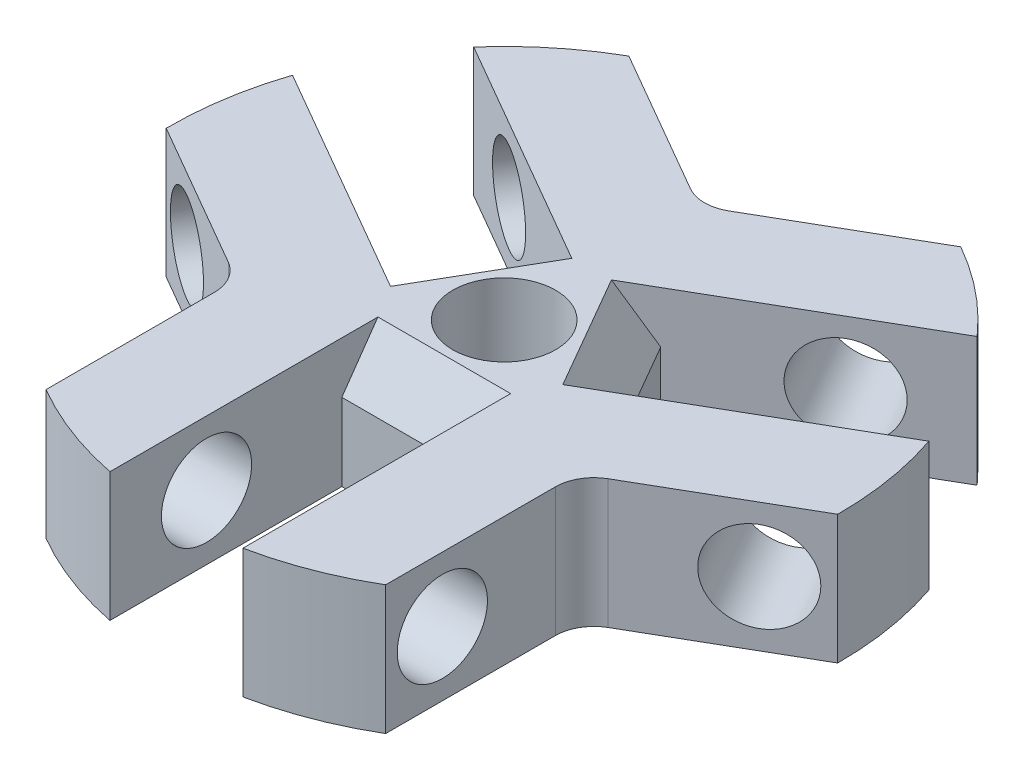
ISO-10303-21;
HEADER;
FILE_DESCRIPTION(('STEP AP214'),'2;1');
FILE_NAME('part.step','',(''),(''),'','','');
FILE_SCHEMA(('AUTOMOTIVE_DESIGN { 1 0 10303 214 1 1 1 1 }'));
ENDSEC;
DATA;
#1=APPLICATION_CONTEXT('core data for automotive mechanical design processes');
#2=APPLICATION_PROTOCOL_DEFINITION('international standard','automotive_design',2000,#1);
#3=PRODUCT_CONTEXT('',#1,'mechanical');
#4=PRODUCT('Part','Part','',(#3));
#5=PRODUCT_RELATED_PRODUCT_CATEGORY('part','',(#4));
#6=PRODUCT_DEFINITION_FORMATION('','',#4);
#7=PRODUCT_DEFINITION_CONTEXT('part definition',#1,'design');
#8=PRODUCT_DEFINITION('design','',#6,#7);
#9=PRODUCT_DEFINITION_SHAPE('','',#8);
#10=(LENGTH_UNIT() NAMED_UNIT(*) SI_UNIT(.MILLI.,.METRE.));
#11=(NAMED_UNIT(*) PLANE_ANGLE_UNIT() SI_UNIT($,.RADIAN.));
#12=(NAMED_UNIT(*) SI_UNIT($,.STERADIAN.) SOLID_ANGLE_UNIT());
#13=UNCERTAINTY_MEASURE_WITH_UNIT(LENGTH_MEASURE(1.E-05),#10,'distance_accuracy_value','');
#14=(GEOMETRIC_REPRESENTATION_CONTEXT(3) GLOBAL_UNCERTAINTY_ASSIGNED_CONTEXT((#13)) GLOBAL_UNIT_ASSIGNED_CONTEXT((#10,
#11,#12)) REPRESENTATION_CONTEXT('',''));
#15=CARTESIAN_POINT('',(0.,0.,0.));
#16=DIRECTION('',(0.,0.,1.));
#17=DIRECTION('',(1.,0.,0.));
#18=AXIS2_PLACEMENT_3D('',#15,#16,#17);
#19=CARTESIAN_POINT('',(0.,0.,0.));
#20=DIRECTION('',(0.,-1.,0.));
#21=DIRECTION('',(0.,0.,-1.));
#22=AXIS2_PLACEMENT_3D('',#19,#20,#21);
#23=CYLINDRICAL_SURFACE('',#22,13.);
#24=CARTESIAN_POINT('',(0.,0.,0.));
#25=DIRECTION('',(0.,-1.,0.));
#26=DIRECTION('',(0.,0.,-1.));
#27=AXIS2_PLACEMENT_3D('',#24,#25,#26);
#28=CIRCLE('',#27,13.);
#29=CARTESIAN_POINT('',(-12.9994845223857,0.,0.115767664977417));
#30=VERTEX_POINT('',#29);
#31=CARTESIAN_POINT('',(-12.3308657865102,-1.11022302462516E-13,-4.11700728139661));
#32=VERTEX_POINT('',#31);
#33=EDGE_CURVE('E235',#30,#32,#28,.T.);
#34=ORIENTED_EDGE('',*,*,#33,.F.);
#35=DIRECTION('',(0.,1.,0.));
#36=VECTOR('',#35,1.);
#37=CARTESIAN_POINT('',(-12.9994845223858,-5.00000000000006,0.115767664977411));
#38=LINE('',#37,#36);
#39=CARTESIAN_POINT('',(-12.9994845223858,4.99999999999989,0.11576766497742));
#40=VERTEX_POINT('',#39);
#41=EDGE_CURVE('E222',#30,#40,#38,.T.);
#42=ORIENTED_EDGE('',*,*,#41,.T.);
#43=CARTESIAN_POINT('',(0.,5.,0.));
#44=DIRECTION('',(0.,-1.,0.));
#45=DIRECTION('',(0.,0.,-1.));
#46=AXIS2_PLACEMENT_3D('',#43,#44,#45);
#47=CIRCLE('',#46,13.);
#48=CARTESIAN_POINT('',(-12.3308657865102,4.99999999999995,-4.11700728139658));
#49=VERTEX_POINT('',#48);
#50=EDGE_CURVE('E233',#40,#49,#47,.T.);
#51=ORIENTED_EDGE('',*,*,#50,.T.);
#52=DIRECTION('',(0.,-1.,0.));
#53=VECTOR('',#52,1.);
#54=CARTESIAN_POINT('',(-12.3308657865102,-1.11022302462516E-13,-4.11700728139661));
#55=LINE('',#54,#53);
#56=EDGE_CURVE('E333',#49,#32,#55,.T.);
#57=ORIENTED_EDGE('',*,*,#56,.T.);
#58=EDGE_LOOP('',(#34,#42,#51,#57));
#59=FACE_BOUND('',#58,.T.);
#60=ADVANCED_FACE('F38',(#59),#23,.T.);
#61=CARTESIAN_POINT('',(6.39948452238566,0.,-11.3157676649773));
#62=VERTEX_POINT('',#61);
#63=CARTESIAN_POINT('',(9.7308657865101,0.,-8.6203393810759));
#64=VERTEX_POINT('',#63);
#65=EDGE_CURVE('E272',#62,#64,#28,.T.);
#66=ORIENTED_EDGE('',*,*,#65,.F.);
#67=DIRECTION('',(0.,1.,0.));
#68=VECTOR('',#67,1.);
#69=CARTESIAN_POINT('',(6.39948452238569,-5.00000000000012,-11.3157676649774));
#70=LINE('',#69,#68);
#71=CARTESIAN_POINT('',(6.39948452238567,4.99999999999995,-11.3157676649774));
#72=VERTEX_POINT('',#71);
#73=EDGE_CURVE('E299',#62,#72,#70,.T.);
#74=ORIENTED_EDGE('',*,*,#73,.T.);
#75=CARTESIAN_POINT('',(9.73086578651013,5.,-8.6203393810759));
#76=VERTEX_POINT('',#75);
#77=EDGE_CURVE('E245',#72,#76,#47,.T.);
#78=ORIENTED_EDGE('',*,*,#77,.T.);
#79=DIRECTION('',(0.,-1.,0.));
#80=VECTOR('',#79,1.);
#81=CARTESIAN_POINT('',(9.7308657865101,0.,-8.6203393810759));
#82=LINE('',#81,#80);
#83=EDGE_CURVE('E447',#76,#64,#82,.T.);
#84=ORIENTED_EDGE('',*,*,#83,.T.);
#85=EDGE_LOOP('',(#66,#74,#78,#84));
#86=FACE_BOUND('',#85,.T.);
#87=ADVANCED_FACE('F470',(#86),#23,.T.);
#88=CARTESIAN_POINT('',(6.60000000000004,0.,11.2000000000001));
#89=VERTEX_POINT('',#88);
#90=CARTESIAN_POINT('',(2.6,0.,12.7373466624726));
#91=VERTEX_POINT('',#90);
#92=EDGE_CURVE('E275',#89,#91,#28,.T.);
#93=ORIENTED_EDGE('',*,*,#92,.F.);
#94=DIRECTION('',(0.,-1.,0.));
#95=VECTOR('',#94,1.);
#96=CARTESIAN_POINT('',(6.60000000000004,0.,11.2000000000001));
#97=LINE('',#96,#95);
#98=CARTESIAN_POINT('',(6.60000000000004,4.99999999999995,11.2));
#99=VERTEX_POINT('',#98);
#100=EDGE_CURVE('E441',#89,#99,#97,.F.);
#101=ORIENTED_EDGE('',*,*,#100,.T.);
#102=CARTESIAN_POINT('',(2.60000000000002,4.99999999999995,12.7373466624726));
#103=VERTEX_POINT('',#102);
#104=EDGE_CURVE('E250',#99,#103,#47,.T.);
#105=ORIENTED_EDGE('',*,*,#104,.T.);
#106=DIRECTION('',(0.,-1.,0.));
#107=VECTOR('',#106,1.);
#108=CARTESIAN_POINT('',(2.6,0.,12.7373466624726));
#109=LINE('',#108,#107);
#110=EDGE_CURVE('E452',#103,#91,#109,.T.);
#111=ORIENTED_EDGE('',*,*,#110,.T.);
#112=EDGE_LOOP('',(#93,#101,#105,#111));
#113=FACE_BOUND('',#112,.T.);
#114=ADVANCED_FACE('F474',(#113),#23,.T.);
#115=CARTESIAN_POINT('',(-2.54999999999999,4.99999999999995,12.7474507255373));
#116=VERTEX_POINT('',#115);
#117=CARTESIAN_POINT('',(-6.54999999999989,5.,11.2293143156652));
#118=VERTEX_POINT('',#117);
#119=EDGE_CURVE('E242',#116,#118,#47,.T.);
#120=ORIENTED_EDGE('',*,*,#119,.T.);
#121=DIRECTION('',(0.,1.,0.));
#122=VECTOR('',#121,1.);
#123=CARTESIAN_POINT('',(-6.54999999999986,-5.00000000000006,11.2293143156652));
#124=LINE('',#123,#122);
#125=CARTESIAN_POINT('',(-6.54999999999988,0.,11.2293143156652));
#126=VERTEX_POINT('',#125);
#127=EDGE_CURVE('E228',#126,#118,#124,.T.);
#128=ORIENTED_EDGE('',*,*,#127,.F.);
#129=CARTESIAN_POINT('',(-2.55000000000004,0.,12.7474507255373));
#130=VERTEX_POINT('',#129);
#131=EDGE_CURVE('E259',#130,#126,#28,.T.);
#132=ORIENTED_EDGE('',*,*,#131,.F.);
#133=DIRECTION('',(0.,-1.,0.));
#134=VECTOR('',#133,1.);
#135=CARTESIAN_POINT('',(-2.55000000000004,0.,12.7474507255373));
#136=LINE('',#135,#134);
#137=EDGE_CURVE('E454',#130,#116,#136,.F.);
#138=ORIENTED_EDGE('',*,*,#137,.T.);
#139=EDGE_LOOP('',(#120,#128,#132,#138));
#140=FACE_BOUND('',#139,.T.);
#141=ADVANCED_FACE('F466',(#140),#23,.T.);
#142=CARTESIAN_POINT('',(-9.76461616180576,4.99999999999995,-8.58209014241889));
#143=VERTEX_POINT('',#142);
#144=CARTESIAN_POINT('',(-6.44987146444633,5.,-11.2871235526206));
#145=VERTEX_POINT('',#144);
#146=EDGE_CURVE('E243',#143,#145,#47,.T.);
#147=ORIENTED_EDGE('',*,*,#146,.T.);
#148=DIRECTION('',(0.,1.,0.));
#149=VECTOR('',#148,1.);
#150=CARTESIAN_POINT('',(-6.44987146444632,-5.00000000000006,-11.2871235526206));
#151=LINE('',#150,#149);
#152=CARTESIAN_POINT('',(-6.44987146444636,0.,-11.2871235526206));
#153=VERTEX_POINT('',#152);
#154=EDGE_CURVE('E295',#153,#145,#151,.T.);
#155=ORIENTED_EDGE('',*,*,#154,.F.);
#156=CARTESIAN_POINT('',(-9.76461616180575,0.,-8.5820901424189));
#157=VERTEX_POINT('',#156);
#158=EDGE_CURVE('E271',#157,#153,#28,.T.);
#159=ORIENTED_EDGE('',*,*,#158,.F.);
#160=DIRECTION('',(0.,-1.,0.));
#161=VECTOR('',#160,1.);
#162=CARTESIAN_POINT('',(-9.76461616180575,0.,-8.5820901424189));
#163=LINE('',#162,#161);
#164=EDGE_CURVE('E293',#157,#143,#163,.F.);
#165=ORIENTED_EDGE('',*,*,#164,.T.);
#166=EDGE_LOOP('',(#147,#155,#159,#165));
#167=FACE_BOUND('',#166,.T.);
#168=ADVANCED_FACE('F292',(#167),#23,.T.);
#169=CARTESIAN_POINT('',(-13.,0.,0.));
#170=DIRECTION('',(0.,1.,0.));
#171=DIRECTION('',(0.,0.,1.));
#172=AXIS2_PLACEMENT_3D('',#169,#170,#171);
#173=PLANE('',#172);
#174=DIRECTION('',(0.,0.,-1.));
#175=VECTOR('',#174,1.);
#176=CARTESIAN_POINT('',(-6.55000000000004,0.,0.));
#177=LINE('',#176,#175);
#178=CARTESIAN_POINT('',(-6.54999999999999,0.,4.7054046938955));
#179=VERTEX_POINT('',#178);
#180=EDGE_CURVE('E236',#126,#179,#177,.T.);
#181=ORIENTED_EDGE('',*,*,#180,.T.);
#182=CARTESIAN_POINT('',(-8.04999999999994,-1.11022302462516E-13,4.70540469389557));
#183=DIRECTION('',(0.,1.,0.));
#184=DIRECTION('',(0.,0.,1.));
#185=AXIS2_PLACEMENT_3D('',#182,#183,#184);
#186=CIRCLE('',#185,1.5);
#187=CARTESIAN_POINT('',(-7.29999999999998,0.,3.40636658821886));
#188=VERTEX_POINT('',#187);
#189=EDGE_CURVE('E406',#179,#188,#186,.T.);
#190=ORIENTED_EDGE('',*,*,#189,.T.);
#191=DIRECTION('',(-0.866025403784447,0.,-0.499999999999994));
#192=VECTOR('',#191,1.);
#193=CARTESIAN_POINT('',(-13.0500000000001,0.,0.0866025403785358));
#194=LINE('',#193,#192);
#195=EDGE_CURVE('E518',#188,#30,#194,.T.);
#196=ORIENTED_EDGE('',*,*,#195,.T.);
#197=ORIENTED_EDGE('',*,*,#33,.T.);
#198=DIRECTION('',(0.866025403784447,0.,0.499999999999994));
#199=VECTOR('',#198,1.);
#200=CARTESIAN_POINT('',(-11.0500000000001,0.,-3.37749907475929));
#201=LINE('',#200,#199);
#202=CARTESIAN_POINT('',(-4.54759526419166,0.,0.376666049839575));
#203=VERTEX_POINT('',#202);
#204=EDGE_CURVE('E330',#32,#203,#201,.T.);
#205=ORIENTED_EDGE('',*,*,#204,.T.);
#206=DIRECTION('',(0.499999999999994,0.,-0.866025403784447));
#207=VECTOR('',#206,1.);
#208=CARTESIAN_POINT('',(-6.49759526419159,0.,3.75416512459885));
#209=LINE('',#208,#207);
#210=CARTESIAN_POINT('',(-1.97259526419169,0.,-4.08336477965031));
#211=VERTEX_POINT('',#210);
#212=EDGE_CURVE('E324',#203,#211,#209,.T.);
#213=ORIENTED_EDGE('',*,*,#212,.T.);
#214=DIRECTION('',(-0.866025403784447,0.,-0.499999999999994));
#215=VECTOR('',#214,1.);
#216=CARTESIAN_POINT('',(-8.47500000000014,0.,-7.83752990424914));
#217=LINE('',#216,#215);
#218=EDGE_CURVE('E288',#211,#157,#217,.T.);
#219=ORIENTED_EDGE('',*,*,#218,.T.);
#220=ORIENTED_EDGE('',*,*,#158,.T.);
#221=DIRECTION('',(0.866025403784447,0.,0.499999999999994));
#222=VECTOR('',#221,1.);
#223=CARTESIAN_POINT('',(-6.47500000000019,0.,-11.301631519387));
#224=LINE('',#223,#222);
#225=CARTESIAN_POINT('',(-0.800000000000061,0.,-8.02516874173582));
#226=VERTEX_POINT('',#225);
#227=EDGE_CURVE('E285',#153,#226,#224,.T.);
#228=ORIENTED_EDGE('',*,*,#227,.T.);
#229=CARTESIAN_POINT('',(-0.0500000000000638,0.,-9.32420684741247));
#230=DIRECTION('',(0.,1.,0.));
#231=DIRECTION('',(0.,0.,1.));
#232=AXIS2_PLACEMENT_3D('',#229,#230,#231);
#233=CIRCLE('',#232,1.5);
#234=CARTESIAN_POINT('',(0.699999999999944,0.,-8.02516874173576));
#235=VERTEX_POINT('',#234);
#236=EDGE_CURVE('E423',#226,#235,#233,.T.);
#237=ORIENTED_EDGE('',*,*,#236,.T.);
#238=DIRECTION('',(0.86602540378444,0.,-0.500000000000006));
#239=VECTOR('',#238,1.);
#240=CARTESIAN_POINT('',(-13.05,0.,-0.0866025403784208));
#241=LINE('',#240,#239);
#242=EDGE_CURVE('E307',#235,#62,#241,.T.);
#243=ORIENTED_EDGE('',*,*,#242,.T.);
#244=ORIENTED_EDGE('',*,*,#65,.T.);
#245=DIRECTION('',(-0.86602540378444,0.,0.500000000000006));
#246=VECTOR('',#245,1.);
#247=CARTESIAN_POINT('',(-11.05,0.,3.37749907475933));
#248=LINE('',#247,#246);
#249=CARTESIAN_POINT('',(1.94759526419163,0.,-4.1266660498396));
#250=VERTEX_POINT('',#249);
#251=EDGE_CURVE('E346',#64,#250,#248,.T.);
#252=ORIENTED_EDGE('',*,*,#251,.T.);
#253=DIRECTION('',(0.500000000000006,0.,0.86602540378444));
#254=VECTOR('',#253,1.);
#255=CARTESIAN_POINT('',(-0.0024047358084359,0.,-7.50416512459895));
#256=LINE('',#255,#254);
#257=CARTESIAN_POINT('',(4.52259526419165,-1.11022302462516E-13,0.3333647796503));
#258=VERTEX_POINT('',#257);
#259=EDGE_CURVE('E349',#250,#258,#256,.T.);
#260=ORIENTED_EDGE('',*,*,#259,.T.);
#261=DIRECTION('',(0.86602540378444,0.,-0.500000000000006));
#262=VECTOR('',#261,1.);
#263=CARTESIAN_POINT('',(-8.47499999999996,0.,7.83752990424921));
#264=LINE('',#263,#262);
#265=CARTESIAN_POINT('',(12.3146161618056,0.,-4.16536058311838));
#266=VERTEX_POINT('',#265);
#267=EDGE_CURVE('E343',#258,#266,#264,.T.);
#268=ORIENTED_EDGE('',*,*,#267,.T.);
#269=CARTESIAN_POINT('',(12.9998714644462,1.11022302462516E-13,0.0578092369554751));
#270=VERTEX_POINT('',#269);
#271=EDGE_CURVE('E266',#266,#270,#28,.T.);
#272=ORIENTED_EDGE('',*,*,#271,.T.);
#273=DIRECTION('',(-0.86602540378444,0.,0.500000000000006));
#274=VECTOR('',#273,1.);
#275=CARTESIAN_POINT('',(-6.47499999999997,0.,11.301631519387));
#276=LINE('',#275,#274);
#277=CARTESIAN_POINT('',(7.35000000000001,0.,3.31976404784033));
#278=VERTEX_POINT('',#277);
#279=EDGE_CURVE('E314',#270,#278,#276,.T.);
#280=ORIENTED_EDGE('',*,*,#279,.T.);
#281=CARTESIAN_POINT('',(8.10000000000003,0.,4.61880215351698));
#282=DIRECTION('',(0.,1.,0.));
#283=DIRECTION('',(0.,0.,1.));
#284=AXIS2_PLACEMENT_3D('',#281,#282,#283);
#285=CIRCLE('',#284,1.5);
#286=CARTESIAN_POINT('',(6.60000000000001,0.,4.61880215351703));
#287=VERTEX_POINT('',#286);
#288=EDGE_CURVE('E432',#278,#287,#285,.T.);
#289=ORIENTED_EDGE('',*,*,#288,.T.);
#290=DIRECTION('',(0.,0.,1.));
#291=VECTOR('',#290,1.);
#292=CARTESIAN_POINT('',(6.60000000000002,0.,0.));
#293=LINE('',#292,#291);
#294=EDGE_CURVE('E316',#287,#89,#293,.T.);
#295=ORIENTED_EDGE('',*,*,#294,.T.);
#296=ORIENTED_EDGE('',*,*,#92,.T.);
#297=DIRECTION('',(0.,0.,-1.));
#298=VECTOR('',#297,1.);
#299=CARTESIAN_POINT('',(2.6,0.,0.));
#300=LINE('',#299,#298);
#301=CARTESIAN_POINT('',(2.60000000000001,0.,3.75000000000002));
#302=VERTEX_POINT('',#301);
#303=EDGE_CURVE('E364',#91,#302,#300,.T.);
#304=ORIENTED_EDGE('',*,*,#303,.T.);
#305=DIRECTION('',(-1.,0.,0.));
#306=VECTOR('',#305,1.);
#307=CARTESIAN_POINT('',(-13.,0.,3.75000000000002));
#308=LINE('',#307,#306);
#309=CARTESIAN_POINT('',(-2.55000000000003,0.,3.75));
#310=VERTEX_POINT('',#309);
#311=EDGE_CURVE('E279',#302,#310,#308,.T.);
#312=ORIENTED_EDGE('',*,*,#311,.T.);
#313=DIRECTION('',(0.,0.,1.));
#314=VECTOR('',#313,1.);
#315=CARTESIAN_POINT('',(-2.55000000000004,0.,0.));
#316=LINE('',#315,#314);
#317=EDGE_CURVE('E360',#310,#130,#316,.T.);
#318=ORIENTED_EDGE('',*,*,#317,.T.);
#319=ORIENTED_EDGE('',*,*,#131,.T.);
#320=EDGE_LOOP('',(#181,#190,#196,#197,#205,#213,#219,#220,#228,#237,#243,#244,#252,#260,#268,
#272,#280,#289,#295,#296,#304,#312,#318,#319));
#321=FACE_BOUND('',#320,.T.);
#322=CARTESIAN_POINT('',(0.,0.,0.));
#323=DIRECTION('',(0.,-1.,0.));
#324=DIRECTION('',(0.,0.,-1.));
#325=AXIS2_PLACEMENT_3D('',#322,#323,#324);
#326=CIRCLE('',#325,2.);
#327=CARTESIAN_POINT('',(0.,0.,-2.00000000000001));
#328=VERTEX_POINT('',#327);
#329=EDGE_CURVE('E247',#328,#328,#326,.T.);
#330=ORIENTED_EDGE('',*,*,#329,.F.);
#331=EDGE_LOOP('',(#330));
#332=FACE_BOUND('',#331,.T.);
#333=ADVANCED_FACE('F40',(#321,#332),#173,.F.);
#334=CARTESIAN_POINT('',(0.,0.,0.));
#335=DIRECTION('',(0.,-1.,0.));
#336=DIRECTION('',(0.,0.,-1.));
#337=AXIS2_PLACEMENT_3D('',#334,#335,#336);
#338=CYLINDRICAL_SURFACE('',#337,2.);
#339=CARTESIAN_POINT('',(0.,1.,0.));
#340=DIRECTION('',(0.,1.,0.));
#341=DIRECTION('',(0.,0.,1.));
#342=AXIS2_PLACEMENT_3D('',#339,#340,#341);
#343=CIRCLE('',#342,1.99999999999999);
#344=CARTESIAN_POINT('',(0.,1.,-2.00000000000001));
#345=VERTEX_POINT('',#344);
#346=EDGE_CURVE('E871',#345,#345,#343,.T.);
#347=CARTESIAN_POINT('',(0.,1.,-2.00000000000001));
#348=CARTESIAN_POINT('',(0.,0.989583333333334,-2.00000000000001));
#349=CARTESIAN_POINT('',(0.,0.979166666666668,-2.00000000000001));
#350=CARTESIAN_POINT('',(0.,0.958333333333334,-2.00000000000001));
#351=CARTESIAN_POINT('',(0.,0.947916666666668,-2.00000000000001));
#352=CARTESIAN_POINT('',(0.,0.927083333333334,-2.00000000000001));
#353=CARTESIAN_POINT('',(0.,0.916666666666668,-2.00000000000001));
#354=CARTESIAN_POINT('',(0.,0.895833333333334,-2.00000000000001));
#355=CARTESIAN_POINT('',(0.,0.885416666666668,-2.00000000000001));
#356=CARTESIAN_POINT('',(0.,0.864583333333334,-2.00000000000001));
#357=CARTESIAN_POINT('',(0.,0.854166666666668,-2.00000000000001));
#358=CARTESIAN_POINT('',(0.,0.833333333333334,-2.00000000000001));
#359=CARTESIAN_POINT('',(0.,0.822916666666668,-2.00000000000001));
#360=CARTESIAN_POINT('',(0.,0.802083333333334,-2.00000000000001));
#361=CARTESIAN_POINT('',(0.,0.791666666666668,-2.00000000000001));
#362=CARTESIAN_POINT('',(0.,0.770833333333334,-2.00000000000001));
#363=CARTESIAN_POINT('',(0.,0.760416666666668,-2.00000000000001));
#364=CARTESIAN_POINT('',(0.,0.739583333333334,-2.00000000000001));
#365=CARTESIAN_POINT('',(0.,0.729166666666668,-2.00000000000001));
#366=CARTESIAN_POINT('',(0.,0.708333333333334,-2.00000000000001));
#367=CARTESIAN_POINT('',(0.,0.697916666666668,-2.00000000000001));
#368=CARTESIAN_POINT('',(0.,0.677083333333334,-2.00000000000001));
#369=CARTESIAN_POINT('',(0.,0.666666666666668,-2.00000000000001));
#370=CARTESIAN_POINT('',(0.,0.645833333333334,-2.00000000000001));
#371=CARTESIAN_POINT('',(0.,0.635416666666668,-2.00000000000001));
#372=CARTESIAN_POINT('',(0.,0.614583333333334,-2.00000000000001));
#373=CARTESIAN_POINT('',(0.,0.604166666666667,-2.00000000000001));
#374=CARTESIAN_POINT('',(0.,0.583333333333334,-2.00000000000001));
#375=CARTESIAN_POINT('',(0.,0.572916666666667,-2.00000000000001));
#376=CARTESIAN_POINT('',(0.,0.552083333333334,-2.00000000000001));
#377=CARTESIAN_POINT('',(0.,0.541666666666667,-2.00000000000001));
#378=CARTESIAN_POINT('',(0.,0.520833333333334,-2.00000000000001));
#379=CARTESIAN_POINT('',(0.,0.510416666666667,-2.00000000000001));
#380=CARTESIAN_POINT('',(0.,0.489583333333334,-2.00000000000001));
#381=CARTESIAN_POINT('',(0.,0.479166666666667,-2.00000000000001));
#382=CARTESIAN_POINT('',(0.,0.458333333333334,-2.00000000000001));
#383=CARTESIAN_POINT('',(0.,0.447916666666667,-2.00000000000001));
#384=CARTESIAN_POINT('',(0.,0.427083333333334,-2.00000000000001));
#385=CARTESIAN_POINT('',(0.,0.416666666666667,-2.00000000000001));
#386=CARTESIAN_POINT('',(0.,0.395833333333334,-2.00000000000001));
#387=CARTESIAN_POINT('',(0.,0.385416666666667,-2.00000000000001));
#388=CARTESIAN_POINT('',(0.,0.364583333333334,-2.00000000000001));
#389=CARTESIAN_POINT('',(0.,0.354166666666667,-2.00000000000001));
#390=CARTESIAN_POINT('',(0.,0.333333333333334,-2.00000000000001));
#391=CARTESIAN_POINT('',(0.,0.322916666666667,-2.00000000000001));
#392=CARTESIAN_POINT('',(0.,0.302083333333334,-2.00000000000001));
#393=CARTESIAN_POINT('',(0.,0.291666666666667,-2.00000000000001));
#394=CARTESIAN_POINT('',(0.,0.270833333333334,-2.00000000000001));
#395=CARTESIAN_POINT('',(0.,0.260416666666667,-2.00000000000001));
#396=CARTESIAN_POINT('',(0.,0.239583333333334,-2.00000000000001));
#397=CARTESIAN_POINT('',(0.,0.229166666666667,-2.00000000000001));
#398=CARTESIAN_POINT('',(0.,0.208333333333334,-2.00000000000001));
#399=CARTESIAN_POINT('',(0.,0.197916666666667,-2.00000000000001));
#400=CARTESIAN_POINT('',(0.,0.177083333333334,-2.00000000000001));
#401=CARTESIAN_POINT('',(0.,0.166666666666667,-2.00000000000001));
#402=CARTESIAN_POINT('',(0.,0.145833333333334,-2.00000000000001));
#403=CARTESIAN_POINT('',(0.,0.135416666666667,-2.00000000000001));
#404=CARTESIAN_POINT('',(0.,0.114583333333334,-2.00000000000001));
#405=CARTESIAN_POINT('',(0.,0.104166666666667,-2.00000000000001));
#406=CARTESIAN_POINT('',(0.,0.0833333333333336,-2.00000000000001));
#407=CARTESIAN_POINT('',(0.,0.0729166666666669,-2.00000000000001));
#408=CARTESIAN_POINT('',(0.,0.0520833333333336,-2.00000000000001));
#409=CARTESIAN_POINT('',(0.,0.0416666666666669,-2.00000000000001));
#410=CARTESIAN_POINT('',(0.,0.0208333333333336,-2.00000000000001));
#411=CARTESIAN_POINT('',(0.,0.0104166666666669,-2.00000000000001));
#412=CARTESIAN_POINT('',(0.,0.,-2.00000000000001));
#413=B_SPLINE_CURVE_WITH_KNOTS('',3,(#347,#348,#349,#350,#351,#352,#353,#354,#355,#356,#357,
#358,#359,#360,#361,#362,#363,#364,#365,#366,#367,#368,#369,#370,#371,#372,#373,#374,#375,#376,
#377,#378,#379,#380,#381,#382,#383,#384,#385,#386,#387,#388,#389,#390,#391,#392,#393,#394,#395,
#396,#397,#398,#399,#400,#401,#402,#403,#404,#405,#406,#407,#408,#409,#410,#411,#412),
.UNSPECIFIED.,.F.,.F.,(4,2,2,2,2,2,2,2,2,2,2,2,2,2,2,2,2,2,2,2,2,2,2,2,2,2,2,2,2,2,2,2,4),(0.,
0.0312499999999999,0.0624999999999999,0.09375,0.125,0.15625,0.1875,0.21875,0.25,0.28125,0.3125,
0.34375,0.375,0.40625,0.4375,0.46875,0.5,0.53125,0.5625,0.593750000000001,0.625000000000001,
0.656250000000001,0.687500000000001,0.718750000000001,0.750000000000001,0.781250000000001,
0.812500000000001,0.843750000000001,0.875000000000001,0.906250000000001,0.937500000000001,
0.968750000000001,1.),.UNSPECIFIED.);
#414=EDGE_CURVE('BSEAM459',#345,#328,#413,.T.);
#415=ORIENTED_EDGE('',*,*,#346,.T.);
#416=ORIENTED_EDGE('',*,*,#329,.T.);
#417=ORIENTED_EDGE('',*,*,#414,.T.);
#418=ORIENTED_EDGE('',*,*,#414,.F.);
#419=EDGE_LOOP('',(#415,#417,#416,#418));
#420=FACE_BOUND('',#419,.T.);
#421=ADVANCED_FACE('F459',(#420),#338,.F.);
#422=CARTESIAN_POINT('',(0.,4.99999999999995,0.));
#423=DIRECTION('',(0.,-1.,0.));
#424=DIRECTION('',(0.,0.,-1.));
#425=AXIS2_PLACEMENT_3D('',#422,#423,#424);
#426=PLANE('',#425);
#427=CARTESIAN_POINT('',(0.,4.99999999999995,0.));
#428=DIRECTION('',(0.,1.,0.));
#429=DIRECTION('',(0.,0.,1.));
#430=AXIS2_PLACEMENT_3D('',#427,#428,#429);
#431=CIRCLE('',#430,1.99999999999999);
#432=CARTESIAN_POINT('',(0.,4.99999999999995,1.99999999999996));
#433=VERTEX_POINT('',#432);
#434=EDGE_CURVE('E875',#433,#433,#431,.T.);
#435=ORIENTED_EDGE('',*,*,#434,.F.);
#436=EDGE_LOOP('',(#435));
#437=FACE_BOUND('',#436,.T.);
#438=DIRECTION('',(-0.866025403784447,0.,-0.499999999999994));
#439=VECTOR('',#438,1.);
#440=CARTESIAN_POINT('',(-1.97259526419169,4.99999999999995,-4.0833647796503));
#441=LINE('',#440,#439);
#442=CARTESIAN_POINT('',(-0.759800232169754,4.99999999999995,-3.38315724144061));
#443=VERTEX_POINT('',#442);
#444=EDGE_CURVE('E318',#443,#143,#441,.T.);
#445=ORIENTED_EDGE('',*,*,#444,.F.);
#446=DIRECTION('',(-0.499999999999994,0.,0.866025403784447));
#447=VECTOR('',#446,1.);
#448=CARTESIAN_POINT('',(-2.0348002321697,4.99999999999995,-1.17479246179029));
#449=LINE('',#448,#447);
#450=CARTESIAN_POINT('',(-3.3348002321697,4.99999999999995,1.07687358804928));
#451=VERTEX_POINT('',#450);
#452=EDGE_CURVE('E396',#443,#451,#449,.T.);
#453=ORIENTED_EDGE('',*,*,#452,.T.);
#454=DIRECTION('',(-0.866025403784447,0.,-0.499999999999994));
#455=VECTOR('',#454,1.);
#456=CARTESIAN_POINT('',(-1.29999999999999,4.99999999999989,2.25166604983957));
#457=LINE('',#456,#455);
#458=EDGE_CURVE('E241',#451,#49,#457,.T.);
#459=ORIENTED_EDGE('',*,*,#458,.T.);
#460=ORIENTED_EDGE('',*,*,#50,.F.);
#461=DIRECTION('',(-0.866025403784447,0.,-0.499999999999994));
#462=VECTOR('',#461,1.);
#463=CARTESIAN_POINT('',(-6.54999999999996,4.99999999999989,3.83937929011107));
#464=LINE('',#463,#462);
#465=CARTESIAN_POINT('',(-7.29999999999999,5.,3.40636658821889));
#466=VERTEX_POINT('',#465);
#467=EDGE_CURVE('E218',#466,#40,#464,.T.);
#468=ORIENTED_EDGE('',*,*,#467,.F.);
#469=CARTESIAN_POINT('',(-8.04999999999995,4.99999999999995,4.70540469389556));
#470=DIRECTION('',(0.,-1.,0.));
#471=DIRECTION('',(0.,0.,-1.));
#472=AXIS2_PLACEMENT_3D('',#469,#470,#471);
#473=CIRCLE('',#472,1.5);
#474=CARTESIAN_POINT('',(-6.54999999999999,4.99999999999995,4.70540469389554));
#475=VERTEX_POINT('',#474);
#476=EDGE_CURVE('E418',#466,#475,#473,.T.);
#477=ORIENTED_EDGE('',*,*,#476,.T.);
#478=DIRECTION('',(0.,0.,-1.));
#479=VECTOR('',#478,1.);
#480=CARTESIAN_POINT('',(-6.54999999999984,4.99999999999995,11.2293143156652));
#481=LINE('',#480,#479);
#482=EDGE_CURVE('E229',#118,#475,#481,.T.);
#483=ORIENTED_EDGE('',*,*,#482,.F.);
#484=ORIENTED_EDGE('',*,*,#119,.F.);
#485=DIRECTION('',(0.,0.,1.));
#486=VECTOR('',#485,1.);
#487=CARTESIAN_POINT('',(-2.55000000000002,4.99999999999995,3.75000000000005));
#488=LINE('',#487,#486);
#489=CARTESIAN_POINT('',(-2.55000000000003,4.99999999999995,2.34958492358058));
#490=VERTEX_POINT('',#489);
#491=EDGE_CURVE('E354',#490,#116,#488,.T.);
#492=ORIENTED_EDGE('',*,*,#491,.F.);
#493=DIRECTION('',(1.,0.,0.));
#494=VECTOR('',#493,1.);
#495=CARTESIAN_POINT('',(0.,4.99999999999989,2.34958492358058));
#496=LINE('',#495,#494);
#497=CARTESIAN_POINT('',(2.60000000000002,4.99999999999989,2.34958492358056));
#498=VERTEX_POINT('',#497);
#499=EDGE_CURVE('E398',#490,#498,#496,.T.);
#500=ORIENTED_EDGE('',*,*,#499,.T.);
#501=DIRECTION('',(0.,0.,-1.));
#502=VECTOR('',#501,1.);
#503=CARTESIAN_POINT('',(2.60000000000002,5.,3.75000000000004));
#504=LINE('',#503,#502);
#505=EDGE_CURVE('E352',#103,#498,#504,.T.);
#506=ORIENTED_EDGE('',*,*,#505,.F.);
#507=ORIENTED_EDGE('',*,*,#104,.F.);
#508=DIRECTION('',(0.,0.,1.));
#509=VECTOR('',#508,1.);
#510=CARTESIAN_POINT('',(6.60000000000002,5.,3.75277674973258));
#511=LINE('',#510,#509);
#512=CARTESIAN_POINT('',(6.60000000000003,5.,4.618802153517));
#513=VERTEX_POINT('',#512);
#514=EDGE_CURVE('E312',#513,#99,#511,.T.);
#515=ORIENTED_EDGE('',*,*,#514,.F.);
#516=CARTESIAN_POINT('',(8.10000000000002,4.99999999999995,4.61880215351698));
#517=DIRECTION('',(0.,-1.,0.));
#518=DIRECTION('',(0.,0.,-1.));
#519=AXIS2_PLACEMENT_3D('',#516,#517,#518);
#520=CIRCLE('',#519,1.5);
#521=CARTESIAN_POINT('',(7.35000000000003,4.99999999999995,3.31976404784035));
#522=VERTEX_POINT('',#521);
#523=EDGE_CURVE('E434',#513,#522,#520,.T.);
#524=ORIENTED_EDGE('',*,*,#523,.T.);
#525=DIRECTION('',(-0.86602540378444,0.,0.500000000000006));
#526=VECTOR('',#525,1.);
#527=CARTESIAN_POINT('',(12.9998714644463,4.99999999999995,0.0578092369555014));
#528=LINE('',#527,#526);
#529=CARTESIAN_POINT('',(12.9998714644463,4.99999999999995,0.0578092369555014));
#530=VERTEX_POINT('',#529);
#531=EDGE_CURVE('E309',#530,#522,#528,.T.);
#532=ORIENTED_EDGE('',*,*,#531,.F.);
#533=CARTESIAN_POINT('',(12.3146161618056,5.,-4.16536058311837));
#534=VERTEX_POINT('',#533);
#535=EDGE_CURVE('E248',#534,#530,#47,.T.);
#536=ORIENTED_EDGE('',*,*,#535,.F.);
#537=DIRECTION('',(0.86602540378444,0.,-0.500000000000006));
#538=VECTOR('',#537,1.);
#539=CARTESIAN_POINT('',(4.52259526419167,5.,0.333364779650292));
#540=LINE('',#539,#538);
#541=CARTESIAN_POINT('',(3.30980023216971,4.99999999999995,1.03357231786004));
#542=VERTEX_POINT('',#541);
#543=EDGE_CURVE('E337',#542,#534,#540,.T.);
#544=ORIENTED_EDGE('',*,*,#543,.F.);
#545=DIRECTION('',(-0.500000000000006,0.,-0.86602540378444));
#546=VECTOR('',#545,1.);
#547=CARTESIAN_POINT('',(2.03480023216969,4.99999999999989,-1.1747924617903));
#548=LINE('',#547,#546);
#549=CARTESIAN_POINT('',(0.734800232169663,4.99999999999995,-3.42645851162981));
#550=VERTEX_POINT('',#549);
#551=EDGE_CURVE('E400',#542,#550,#548,.T.);
#552=ORIENTED_EDGE('',*,*,#551,.T.);
#553=DIRECTION('',(-0.86602540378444,0.,0.500000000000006));
#554=VECTOR('',#553,1.);
#555=CARTESIAN_POINT('',(1.94759526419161,4.99999999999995,-4.12666604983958));
#556=LINE('',#555,#554);
#557=EDGE_CURVE('E335',#76,#550,#556,.T.);
#558=ORIENTED_EDGE('',*,*,#557,.F.);
#559=ORIENTED_EDGE('',*,*,#77,.F.);
#560=DIRECTION('',(0.86602540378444,0.,-0.500000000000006));
#561=VECTOR('',#560,1.);
#562=CARTESIAN_POINT('',(-0.050000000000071,4.99999999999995,-7.59215603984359));
#563=LINE('',#562,#561);
#564=CARTESIAN_POINT('',(0.699999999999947,4.99999999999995,-8.02516874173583));
#565=VERTEX_POINT('',#564);
#566=EDGE_CURVE('E300',#565,#72,#563,.T.);
#567=ORIENTED_EDGE('',*,*,#566,.F.);
#568=CARTESIAN_POINT('',(-0.0500000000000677,4.99999999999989,-9.32420684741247));
#569=DIRECTION('',(0.,-1.,0.));
#570=DIRECTION('',(0.,0.,-1.));
#571=AXIS2_PLACEMENT_3D('',#568,#569,#570);
#572=CIRCLE('',#571,1.5);
#573=CARTESIAN_POINT('',(-0.800000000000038,4.99999999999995,-8.02516874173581));
#574=VERTEX_POINT('',#573);
#575=EDGE_CURVE('E425',#565,#574,#572,.T.);
#576=ORIENTED_EDGE('',*,*,#575,.T.);
#577=DIRECTION('',(0.866025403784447,0.,0.499999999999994));
#578=VECTOR('',#577,1.);
#579=CARTESIAN_POINT('',(-6.44987146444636,4.99999999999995,-11.2871235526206));
#580=LINE('',#579,#578);
#581=EDGE_CURVE('E303',#145,#574,#580,.T.);
#582=ORIENTED_EDGE('',*,*,#581,.F.);
#583=ORIENTED_EDGE('',*,*,#146,.F.);
#584=EDGE_LOOP('',(#445,#453,#459,#460,#468,#477,#483,#484,#492,#500,#506,#507,#515,#524,#532,
#536,#544,#552,#558,#559,#567,#576,#582,#583));
#585=FACE_BOUND('',#584,.T.);
#586=ADVANCED_FACE('F239',(#437,#585),#426,.F.);
#587=ORIENTED_EDGE('',*,*,#535,.T.);
#588=DIRECTION('',(0.,-1.,0.));
#589=VECTOR('',#588,1.);
#590=CARTESIAN_POINT('',(12.9998714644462,1.11022302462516E-13,0.0578092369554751));
#591=LINE('',#590,#589);
#592=EDGE_CURVE('E443',#530,#270,#591,.T.);
#593=ORIENTED_EDGE('',*,*,#592,.T.);
#594=ORIENTED_EDGE('',*,*,#271,.F.);
#595=DIRECTION('',(0.,-1.,0.));
#596=VECTOR('',#595,1.);
#597=CARTESIAN_POINT('',(12.3146161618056,0.,-4.16536058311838));
#598=LINE('',#597,#596);
#599=EDGE_CURVE('E449',#266,#534,#598,.F.);
#600=ORIENTED_EDGE('',*,*,#599,.T.);
#601=EDGE_LOOP('',(#587,#593,#594,#600));
#602=FACE_BOUND('',#601,.T.);
#603=ADVANCED_FACE('F468',(#602),#23,.T.);
#604=CARTESIAN_POINT('',(2.6,-5.00000000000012,3.75000000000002));
#605=DIRECTION('',(0.,0.,-1.));
#606=DIRECTION('',(-1.,0.,0.));
#607=AXIS2_PLACEMENT_3D('',#604,#605,#606);
#608=PLANE('',#607);
#609=DIRECTION('',(0.,1.,0.));
#610=VECTOR('',#609,1.);
#611=CARTESIAN_POINT('',(2.6,-5.00000000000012,3.75000000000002));
#612=LINE('',#611,#610);
#613=CARTESIAN_POINT('',(2.6,3.,3.75000000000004));
#614=VERTEX_POINT('',#613);
#615=EDGE_CURVE('E356',#302,#614,#612,.T.);
#616=ORIENTED_EDGE('',*,*,#615,.T.);
#617=DIRECTION('',(-1.,0.,0.));
#618=VECTOR('',#617,1.);
#619=CARTESIAN_POINT('',(2.6,3.,3.75000000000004));
#620=LINE('',#619,#618);
#621=CARTESIAN_POINT('',(-2.55,2.99999999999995,3.75000000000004));
#622=VERTEX_POINT('',#621);
#623=EDGE_CURVE('E394',#614,#622,#620,.T.);
#624=ORIENTED_EDGE('',*,*,#623,.T.);
#625=DIRECTION('',(0.,1.,0.));
#626=VECTOR('',#625,1.);
#627=CARTESIAN_POINT('',(-2.55000000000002,-5.00000000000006,3.74999999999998));
#628=LINE('',#627,#626);
#629=EDGE_CURVE('E357',#310,#622,#628,.T.);
#630=ORIENTED_EDGE('',*,*,#629,.F.);
#631=ORIENTED_EDGE('',*,*,#311,.F.);
#632=EDGE_LOOP('',(#616,#624,#630,#631));
#633=FACE_BOUND('',#632,.T.);
#634=ADVANCED_FACE('F371',(#633),#608,.F.);
#635=CARTESIAN_POINT('',(2.6,-5.00000000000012,3.75000000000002));
#636=DIRECTION('',(1.,0.,0.));
#637=DIRECTION('',(0.,0.,-1.));
#638=AXIS2_PLACEMENT_3D('',#635,#636,#637);
#639=PLANE('',#638);
#640=CARTESIAN_POINT('',(2.6,2.49999999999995,8.99999999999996));
#641=DIRECTION('',(1.,0.,0.));
#642=DIRECTION('',(0.,0.,-1.));
#643=AXIS2_PLACEMENT_3D('',#640,#641,#642);
#644=CIRCLE('',#643,1.75);
#645=CARTESIAN_POINT('',(2.6,2.49999999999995,7.24999999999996));
#646=VERTEX_POINT('',#645);
#647=EDGE_CURVE('E624',#646,#646,#644,.T.);
#648=ORIENTED_EDGE('',*,*,#647,.T.);
#649=EDGE_LOOP('',(#648));
#650=FACE_BOUND('',#649,.T.);
#651=ORIENTED_EDGE('',*,*,#110,.F.);
#652=ORIENTED_EDGE('',*,*,#505,.T.);
#653=DIRECTION('',(0.,0.819152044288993,-0.573576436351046));
#654=VECTOR('',#653,1.);
#655=CARTESIAN_POINT('',(2.60000000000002,-2.36808057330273,7.50877048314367));
#656=LINE('',#655,#654);
#657=EDGE_CURVE('E377',#498,#614,#656,.F.);
#658=ORIENTED_EDGE('',*,*,#657,.T.);
#659=ORIENTED_EDGE('',*,*,#615,.F.);
#660=ORIENTED_EDGE('',*,*,#303,.F.);
#661=EDGE_LOOP('',(#651,#652,#658,#659,#660));
#662=FACE_BOUND('',#661,.T.);
#663=ADVANCED_FACE('F375',(#650,#662),#639,.F.);
#664=CARTESIAN_POINT('',(-2.55000000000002,-5.00000000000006,3.74999999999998));
#665=DIRECTION('',(-1.,0.,0.));
#666=DIRECTION('',(0.,0.,1.));
#667=AXIS2_PLACEMENT_3D('',#664,#665,#666);
#668=PLANE('',#667);
#669=CARTESIAN_POINT('',(-2.54999999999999,2.5,9.00000000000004));
#670=DIRECTION('',(-1.,0.,0.));
#671=DIRECTION('',(0.,0.,1.));
#672=AXIS2_PLACEMENT_3D('',#669,#670,#671);
#673=CIRCLE('',#672,1.75);
#674=CARTESIAN_POINT('',(-2.54999999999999,2.5,10.75));
#675=VERTEX_POINT('',#674);
#676=EDGE_CURVE('E626',#675,#675,#673,.T.);
#677=ORIENTED_EDGE('',*,*,#676,.T.);
#678=EDGE_LOOP('',(#677));
#679=FACE_BOUND('',#678,.T.);
#680=ORIENTED_EDGE('',*,*,#629,.T.);
#681=DIRECTION('',(0.,-0.819152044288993,0.573576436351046));
#682=VECTOR('',#681,1.);
#683=CARTESIAN_POINT('',(-2.55000000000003,-2.36808057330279,7.50877048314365));
#684=LINE('',#683,#682);
#685=EDGE_CURVE('E382',#622,#490,#684,.F.);
#686=ORIENTED_EDGE('',*,*,#685,.T.);
#687=ORIENTED_EDGE('',*,*,#491,.T.);
#688=ORIENTED_EDGE('',*,*,#137,.F.);
#689=ORIENTED_EDGE('',*,*,#317,.F.);
#690=EDGE_LOOP('',(#680,#686,#687,#688,#689));
#691=FACE_BOUND('',#690,.T.);
#692=ADVANCED_FACE('F503',(#679,#691),#668,.F.);
#693=CARTESIAN_POINT('',(1.94759526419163,-5.00000000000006,-4.1266660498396));
#694=DIRECTION('',(-0.86602540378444,0.,0.500000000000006));
#695=DIRECTION('',(0.500000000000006,0.,0.86602540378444));
#696=AXIS2_PLACEMENT_3D('',#693,#694,#695);
#697=PLANE('',#696);
#698=DIRECTION('',(0.,1.,0.));
#699=VECTOR('',#698,1.);
#700=CARTESIAN_POINT('',(1.94759526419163,-5.00000000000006,-4.1266660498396));
#701=LINE('',#700,#699);
#702=CARTESIAN_POINT('',(1.94759526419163,2.99999999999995,-4.12666604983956));
#703=VERTEX_POINT('',#702);
#704=EDGE_CURVE('E339',#250,#703,#701,.T.);
#705=ORIENTED_EDGE('',*,*,#704,.T.);
#706=DIRECTION('',(0.500000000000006,0.,0.86602540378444));
#707=VECTOR('',#706,1.);
#708=CARTESIAN_POINT('',(1.94759526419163,2.99999999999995,-4.12666604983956));
#709=LINE('',#708,#707);
#710=CARTESIAN_POINT('',(4.52259526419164,3.,0.333364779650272));
#711=VERTEX_POINT('',#710);
#712=EDGE_CURVE('E392',#703,#711,#709,.T.);
#713=ORIENTED_EDGE('',*,*,#712,.T.);
#714=DIRECTION('',(0.,1.,0.));
#715=VECTOR('',#714,1.);
#716=CARTESIAN_POINT('',(4.52259526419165,-5.,0.333364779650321));
#717=LINE('',#716,#715);
#718=EDGE_CURVE('E340',#258,#711,#717,.T.);
#719=ORIENTED_EDGE('',*,*,#718,.F.);
#720=ORIENTED_EDGE('',*,*,#259,.F.);
#721=EDGE_LOOP('',(#705,#713,#719,#720));
#722=FACE_BOUND('',#721,.T.);
#723=ADVANCED_FACE('F535',(#722),#697,.F.);
#724=CARTESIAN_POINT('',(1.94759526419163,-5.00000000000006,-4.1266660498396));
#725=DIRECTION('',(-0.500000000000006,0.,-0.86602540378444));
#726=DIRECTION('',(-0.86602540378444,0.,0.500000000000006));
#727=AXIS2_PLACEMENT_3D('',#724,#725,#726);
#728=PLANE('',#727);
#729=CARTESIAN_POINT('',(6.49422863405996,2.5,-6.75166604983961));
#730=DIRECTION('',(-0.500000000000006,0.,-0.86602540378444));
#731=DIRECTION('',(-0.86602540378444,0.,0.500000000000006));
#732=AXIS2_PLACEMENT_3D('',#729,#730,#731);
#733=CIRCLE('',#732,1.75);
#734=CARTESIAN_POINT('',(4.97868417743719,2.5,-5.87666604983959));
#735=VERTEX_POINT('',#734);
#736=EDGE_CURVE('E510',#735,#735,#733,.T.);
#737=ORIENTED_EDGE('',*,*,#736,.T.);
#738=EDGE_LOOP('',(#737));
#739=FACE_BOUND('',#738,.T.);
#740=ORIENTED_EDGE('',*,*,#83,.F.);
#741=ORIENTED_EDGE('',*,*,#557,.T.);
#742=DIRECTION('',(-0.496731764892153,0.819152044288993,0.286788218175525));
#743=VECTOR('',#742,1.);
#744=CARTESIAN_POINT('',(5.20278598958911,-2.36808057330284,-6.00605129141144));
#745=LINE('',#744,#743);
#746=EDGE_CURVE('E11',#550,#703,#745,.F.);
#747=ORIENTED_EDGE('',*,*,#746,.T.);
#748=ORIENTED_EDGE('',*,*,#704,.F.);
#749=ORIENTED_EDGE('',*,*,#251,.F.);
#750=EDGE_LOOP('',(#740,#741,#747,#748,#749));
#751=FACE_BOUND('',#750,.T.);
#752=ADVANCED_FACE('F532',(#739,#751),#728,.F.);
#753=CARTESIAN_POINT('',(4.52259526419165,-5.,0.333364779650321));
#754=DIRECTION('',(0.500000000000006,0.,0.86602540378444));
#755=DIRECTION('',(0.86602540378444,0.,-0.500000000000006));
#756=AXIS2_PLACEMENT_3D('',#753,#754,#755);
#757=PLANE('',#756);
#758=CARTESIAN_POINT('',(9.06922863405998,2.50000000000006,-2.29163522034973));
#759=DIRECTION('',(0.500000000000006,0.,0.86602540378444));
#760=DIRECTION('',(0.86602540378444,0.,-0.500000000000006));
#761=AXIS2_PLACEMENT_3D('',#758,#759,#760);
#762=CIRCLE('',#761,1.75);
#763=CARTESIAN_POINT('',(10.5847730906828,2.50000000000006,-3.16663522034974));
#764=VERTEX_POINT('',#763);
#765=EDGE_CURVE('E415',#764,#764,#762,.T.);
#766=ORIENTED_EDGE('',*,*,#765,.T.);
#767=EDGE_LOOP('',(#766));
#768=FACE_BOUND('',#767,.T.);
#769=ORIENTED_EDGE('',*,*,#718,.T.);
#770=DIRECTION('',(0.496731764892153,-0.819152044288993,-0.286788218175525));
#771=VECTOR('',#770,1.);
#772=CARTESIAN_POINT('',(7.77778598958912,-2.36808057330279,-1.54602046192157));
#773=LINE('',#772,#771);
#774=EDGE_CURVE('E46',#711,#542,#773,.F.);
#775=ORIENTED_EDGE('',*,*,#774,.T.);
#776=ORIENTED_EDGE('',*,*,#543,.T.);
#777=ORIENTED_EDGE('',*,*,#599,.F.);
#778=ORIENTED_EDGE('',*,*,#267,.F.);
#779=EDGE_LOOP('',(#769,#775,#776,#777,#778));
#780=FACE_BOUND('',#779,.T.);
#781=ADVANCED_FACE('F606',(#768,#780),#757,.F.);
#782=CARTESIAN_POINT('',(-4.54759526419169,-5.00000000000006,0.376666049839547));
#783=DIRECTION('',(-0.499999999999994,0.,0.866025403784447));
#784=DIRECTION('',(0.866025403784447,0.,0.499999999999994));
#785=AXIS2_PLACEMENT_3D('',#782,#783,#784);
#786=PLANE('',#785);
#787=CARTESIAN_POINT('',(-9.09422863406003,2.5,-2.24833395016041));
#788=DIRECTION('',(-0.499999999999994,0.,0.866025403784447));
#789=DIRECTION('',(0.866025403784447,0.,0.499999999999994));
#790=AXIS2_PLACEMENT_3D('',#787,#788,#789);
#791=CIRCLE('',#790,1.75);
#792=CARTESIAN_POINT('',(-7.57868417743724,2.5,-1.37333395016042));
#793=VERTEX_POINT('',#792);
#794=EDGE_CURVE('E637',#793,#793,#791,.T.);
#795=ORIENTED_EDGE('',*,*,#794,.T.);
#796=EDGE_LOOP('',(#795));
#797=FACE_BOUND('',#796,.T.);
#798=ORIENTED_EDGE('',*,*,#458,.F.);
#799=DIRECTION('',(0.496731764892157,0.819152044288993,0.286788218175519));
#800=VECTOR('',#799,1.);
#801=CARTESIAN_POINT('',(-7.80278598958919,-2.36808057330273,-1.50271919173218));
#802=LINE('',#801,#800);
#803=CARTESIAN_POINT('',(-4.54759526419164,2.99999999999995,0.37666604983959));
#804=VERTEX_POINT('',#803);
#805=EDGE_CURVE('E385',#451,#804,#802,.F.);
#806=ORIENTED_EDGE('',*,*,#805,.T.);
#807=DIRECTION('',(0.,1.,0.));
#808=VECTOR('',#807,1.);
#809=CARTESIAN_POINT('',(-4.54759526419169,-5.00000000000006,0.376666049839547));
#810=LINE('',#809,#808);
#811=EDGE_CURVE('E320',#203,#804,#810,.T.);
#812=ORIENTED_EDGE('',*,*,#811,.F.);
#813=ORIENTED_EDGE('',*,*,#204,.F.);
#814=ORIENTED_EDGE('',*,*,#56,.F.);
#815=EDGE_LOOP('',(#798,#806,#812,#813,#814));
#816=FACE_BOUND('',#815,.T.);
#817=ADVANCED_FACE('F599',(#797,#816),#786,.F.);
#818=CARTESIAN_POINT('',(-1.97259526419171,-5.00000000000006,-4.08336477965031));
#819=DIRECTION('',(0.499999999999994,0.,-0.866025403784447));
#820=DIRECTION('',(-0.866025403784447,0.,-0.499999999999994));
#821=AXIS2_PLACEMENT_3D('',#818,#819,#820);
#822=PLANE('',#821);
#823=CARTESIAN_POINT('',(-6.51922863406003,2.5,-6.70836477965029));
#824=DIRECTION('',(0.499999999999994,0.,-0.866025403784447));
#825=DIRECTION('',(-0.866025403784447,0.,-0.499999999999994));
#826=AXIS2_PLACEMENT_3D('',#823,#824,#825);
#827=CIRCLE('',#826,1.75);
#828=CARTESIAN_POINT('',(-8.03477309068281,2.5,-7.58336477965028));
#829=VERTEX_POINT('',#828);
#830=EDGE_CURVE('E410',#829,#829,#827,.T.);
#831=ORIENTED_EDGE('',*,*,#830,.T.);
#832=EDGE_LOOP('',(#831));
#833=FACE_BOUND('',#832,.T.);
#834=ORIENTED_EDGE('',*,*,#218,.F.);
#835=DIRECTION('',(0.,1.,0.));
#836=VECTOR('',#835,1.);
#837=CARTESIAN_POINT('',(-1.97259526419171,-5.00000000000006,-4.08336477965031));
#838=LINE('',#837,#836);
#839=CARTESIAN_POINT('',(-1.97259526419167,2.99999999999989,-4.08336477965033));
#840=VERTEX_POINT('',#839);
#841=EDGE_CURVE('E321',#211,#840,#838,.T.);
#842=ORIENTED_EDGE('',*,*,#841,.T.);
#843=DIRECTION('',(-0.496731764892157,-0.819152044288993,-0.286788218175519));
#844=VECTOR('',#843,1.);
#845=CARTESIAN_POINT('',(-5.22778598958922,-2.36808057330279,-5.96275002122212));
#846=LINE('',#845,#844);
#847=EDGE_CURVE('E389',#840,#443,#846,.F.);
#848=ORIENTED_EDGE('',*,*,#847,.T.);
#849=ORIENTED_EDGE('',*,*,#444,.T.);
#850=ORIENTED_EDGE('',*,*,#164,.F.);
#851=EDGE_LOOP('',(#834,#842,#848,#849,#850));
#852=FACE_BOUND('',#851,.T.);
#853=ADVANCED_FACE('F596',(#833,#852),#822,.F.);
#854=CARTESIAN_POINT('',(-4.54759526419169,-5.00000000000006,0.376666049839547));
#855=DIRECTION('',(0.866025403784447,0.,0.499999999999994));
#856=DIRECTION('',(0.499999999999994,0.,-0.866025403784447));
#857=AXIS2_PLACEMENT_3D('',#854,#855,#856);
#858=PLANE('',#857);
#859=ORIENTED_EDGE('',*,*,#811,.T.);
#860=DIRECTION('',(0.499999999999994,0.,-0.866025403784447));
#861=VECTOR('',#860,1.);
#862=CARTESIAN_POINT('',(-4.54759526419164,2.99999999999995,0.37666604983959));
#863=LINE('',#862,#861);
#864=EDGE_CURVE('E403',#804,#840,#863,.T.);
#865=ORIENTED_EDGE('',*,*,#864,.T.);
#866=ORIENTED_EDGE('',*,*,#841,.F.);
#867=ORIENTED_EDGE('',*,*,#212,.F.);
#868=EDGE_LOOP('',(#859,#865,#866,#867));
#869=FACE_BOUND('',#868,.T.);
#870=ADVANCED_FACE('F591',(#869),#858,.F.);
#871=CARTESIAN_POINT('',(6.60000000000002,-5.,3.75277674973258));
#872=DIRECTION('',(-1.,0.,0.));
#873=DIRECTION('',(0.,0.,1.));
#874=AXIS2_PLACEMENT_3D('',#871,#872,#873);
#875=PLANE('',#874);
#876=CARTESIAN_POINT('',(6.60000000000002,2.5,8.99999999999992));
#877=DIRECTION('',(-1.,0.,0.));
#878=DIRECTION('',(0.,0.,1.));
#879=AXIS2_PLACEMENT_3D('',#876,#877,#878);
#880=CIRCLE('',#879,1.75);
#881=CARTESIAN_POINT('',(6.60000000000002,2.5,10.7499999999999));
#882=VERTEX_POINT('',#881);
#883=EDGE_CURVE('E631',#882,#882,#880,.T.);
#884=ORIENTED_EDGE('',*,*,#883,.T.);
#885=EDGE_LOOP('',(#884));
#886=FACE_BOUND('',#885,.T.);
#887=ORIENTED_EDGE('',*,*,#294,.F.);
#888=DIRECTION('',(0.,1.,0.));
#889=VECTOR('',#888,1.);
#890=CARTESIAN_POINT('',(6.60000000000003,5.,4.618802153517));
#891=LINE('',#890,#889);
#892=EDGE_CURVE('E438',#287,#513,#891,.T.);
#893=ORIENTED_EDGE('',*,*,#892,.T.);
#894=ORIENTED_EDGE('',*,*,#514,.T.);
#895=ORIENTED_EDGE('',*,*,#100,.F.);
#896=EDGE_LOOP('',(#887,#893,#894,#895));
#897=FACE_BOUND('',#896,.T.);
#898=ADVANCED_FACE('F498',(#886,#897),#875,.F.);
#899=CARTESIAN_POINT('',(12.9998714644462,-5.00000000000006,0.0578092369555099));
#900=DIRECTION('',(-0.500000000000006,0.,-0.86602540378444));
#901=DIRECTION('',(-0.86602540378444,0.,0.500000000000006));
#902=AXIS2_PLACEMENT_3D('',#899,#900,#901);
#903=PLANE('',#902);
#904=CARTESIAN_POINT('',(11.06922863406,2.5,1.17246639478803));
#905=DIRECTION('',(0.500000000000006,0.,0.86602540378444));
#906=DIRECTION('',(0.866025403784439,0.,-0.500000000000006));
#907=AXIS2_PLACEMENT_3D('',#904,#905,#906);
#908=CIRCLE('',#907,1.75);
#909=CARTESIAN_POINT('',(12.5847730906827,2.5,0.297466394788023));
#910=VERTEX_POINT('',#909);
#911=EDGE_CURVE('E416',#910,#910,#908,.T.);
#912=ORIENTED_EDGE('',*,*,#911,.F.);
#913=EDGE_LOOP('',(#912));
#914=FACE_BOUND('',#913,.T.);
#915=ORIENTED_EDGE('',*,*,#531,.T.);
#916=DIRECTION('',(0.,1.,0.));
#917=VECTOR('',#916,1.);
#918=CARTESIAN_POINT('',(7.35000000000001,0.,3.31976404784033));
#919=LINE('',#918,#917);
#920=EDGE_CURVE('E436',#522,#278,#919,.F.);
#921=ORIENTED_EDGE('',*,*,#920,.T.);
#922=ORIENTED_EDGE('',*,*,#279,.F.);
#923=ORIENTED_EDGE('',*,*,#592,.F.);
#924=EDGE_LOOP('',(#915,#921,#922,#923));
#925=FACE_BOUND('',#924,.T.);
#926=ADVANCED_FACE('F490',(#914,#925),#903,.F.);
#927=CARTESIAN_POINT('',(8.1,-5.00000000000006,4.61880215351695));
#928=DIRECTION('',(0.,-1.,0.));
#929=DIRECTION('',(0.,0.,-1.));
#930=AXIS2_PLACEMENT_3D('',#927,#928,#929);
#931=CYLINDRICAL_SURFACE('',#930,1.5);
#932=ORIENTED_EDGE('',*,*,#288,.F.);
#933=ORIENTED_EDGE('',*,*,#920,.F.);
#934=ORIENTED_EDGE('',*,*,#523,.F.);
#935=ORIENTED_EDGE('',*,*,#892,.F.);
#936=EDGE_LOOP('',(#932,#933,#934,#935));
#937=FACE_BOUND('',#936,.T.);
#938=ADVANCED_FACE('F493',(#937),#931,.F.);
#939=CARTESIAN_POINT('',(-0.0500000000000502,-5.00000000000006,-7.59215603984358));
#940=DIRECTION('',(0.500000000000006,0.,0.86602540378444));
#941=DIRECTION('',(0.86602540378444,0.,-0.500000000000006));
#942=AXIS2_PLACEMENT_3D('',#939,#940,#941);
#943=PLANE('',#942);
#944=CARTESIAN_POINT('',(4.4942286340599,2.5,-10.2157676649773));
#945=DIRECTION('',(0.500000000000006,0.,0.86602540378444));
#946=DIRECTION('',(0.86602540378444,0.,-0.500000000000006));
#947=AXIS2_PLACEMENT_3D('',#944,#945,#946);
#948=CIRCLE('',#947,1.75);
#949=CARTESIAN_POINT('',(6.00977309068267,2.5,-11.0907676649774));
#950=VERTEX_POINT('',#949);
#951=EDGE_CURVE('E412',#950,#950,#948,.T.);
#952=ORIENTED_EDGE('',*,*,#951,.T.);
#953=EDGE_LOOP('',(#952));
#954=FACE_BOUND('',#953,.T.);
#955=ORIENTED_EDGE('',*,*,#242,.F.);
#956=DIRECTION('',(0.,1.,0.));
#957=VECTOR('',#956,1.);
#958=CARTESIAN_POINT('',(0.699999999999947,4.99999999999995,-8.02516874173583));
#959=LINE('',#958,#957);
#960=EDGE_CURVE('E429',#235,#565,#959,.T.);
#961=ORIENTED_EDGE('',*,*,#960,.T.);
#962=ORIENTED_EDGE('',*,*,#566,.T.);
#963=ORIENTED_EDGE('',*,*,#73,.F.);
#964=EDGE_LOOP('',(#955,#961,#962,#963));
#965=FACE_BOUND('',#964,.T.);
#966=ADVANCED_FACE('F528',(#954,#965),#943,.F.);
#967=CARTESIAN_POINT('',(-6.44987146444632,-5.00000000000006,-11.2871235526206));
#968=DIRECTION('',(-0.499999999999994,0.,0.866025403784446));
#969=DIRECTION('',(0.866025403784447,0.,0.499999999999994));
#970=AXIS2_PLACEMENT_3D('',#967,#968,#969);
#971=PLANE('',#970);
#972=CARTESIAN_POINT('',(-4.51922863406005,2.49999999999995,-10.1724663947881));
#973=DIRECTION('',(0.499999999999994,0.,-0.866025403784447));
#974=DIRECTION('',(-0.866025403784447,0.,-0.499999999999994));
#975=AXIS2_PLACEMENT_3D('',#972,#973,#974);
#976=CIRCLE('',#975,1.75);
#977=CARTESIAN_POINT('',(-6.03477309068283,2.49999999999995,-11.047466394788));
#978=VERTEX_POINT('',#977);
#979=EDGE_CURVE('E411',#978,#978,#976,.T.);
#980=ORIENTED_EDGE('',*,*,#979,.F.);
#981=EDGE_LOOP('',(#980));
#982=FACE_BOUND('',#981,.T.);
#983=ORIENTED_EDGE('',*,*,#581,.T.);
#984=DIRECTION('',(0.,1.,0.));
#985=VECTOR('',#984,1.);
#986=CARTESIAN_POINT('',(-0.800000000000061,0.,-8.02516874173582));
#987=LINE('',#986,#985);
#988=EDGE_CURVE('E427',#574,#226,#987,.F.);
#989=ORIENTED_EDGE('',*,*,#988,.T.);
#990=ORIENTED_EDGE('',*,*,#227,.F.);
#991=ORIENTED_EDGE('',*,*,#154,.T.);
#992=EDGE_LOOP('',(#983,#989,#990,#991));
#993=FACE_BOUND('',#992,.T.);
#994=ADVANCED_FACE('F521',(#982,#993),#971,.F.);
#995=CARTESIAN_POINT('',(-6.54999999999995,-5.00000000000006,3.8393792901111));
#996=DIRECTION('',(0.499999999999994,0.,-0.866025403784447));
#997=DIRECTION('',(-0.866025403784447,0.,-0.499999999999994));
#998=AXIS2_PLACEMENT_3D('',#995,#996,#997);
#999=PLANE('',#998);
#1000=CARTESIAN_POINT('',(-11.09422863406,2.5,1.21576766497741));
#1001=DIRECTION('',(0.499999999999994,0.,-0.866025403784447));
#1002=DIRECTION('',(-0.866025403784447,0.,-0.499999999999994));
#1003=AXIS2_PLACEMENT_3D('',#1000,#1001,#1002);
#1004=CIRCLE('',#1003,1.75);
#1005=CARTESIAN_POINT('',(-12.6097730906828,2.5,0.340767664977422));
#1006=VERTEX_POINT('',#1005);
#1007=EDGE_CURVE('E407',#1006,#1006,#1004,.T.);
#1008=ORIENTED_EDGE('',*,*,#1007,.T.);
#1009=EDGE_LOOP('',(#1008));
#1010=FACE_BOUND('',#1009,.T.);
#1011=ORIENTED_EDGE('',*,*,#195,.F.);
#1012=DIRECTION('',(0.,1.,0.));
#1013=VECTOR('',#1012,1.);
#1014=CARTESIAN_POINT('',(-7.29999999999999,5.,3.40636658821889));
#1015=LINE('',#1014,#1013);
#1016=EDGE_CURVE('E225',#188,#466,#1015,.T.);
#1017=ORIENTED_EDGE('',*,*,#1016,.T.);
#1018=ORIENTED_EDGE('',*,*,#467,.T.);
#1019=ORIENTED_EDGE('',*,*,#41,.F.);
#1020=EDGE_LOOP('',(#1011,#1017,#1018,#1019));
#1021=FACE_BOUND('',#1020,.T.);
#1022=ADVANCED_FACE('F221',(#1010,#1021),#999,.F.);
#1023=CARTESIAN_POINT('',(-6.54999999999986,-5.00000000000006,11.2293143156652));
#1024=DIRECTION('',(1.,0.,0.));
#1025=DIRECTION('',(0.,0.,-1.));
#1026=AXIS2_PLACEMENT_3D('',#1023,#1024,#1025);
#1027=PLANE('',#1026);
#1028=CARTESIAN_POINT('',(-6.54999999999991,2.5,9.00000000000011));
#1029=DIRECTION('',(-1.,0.,0.));
#1030=DIRECTION('',(0.,0.,1.));
#1031=AXIS2_PLACEMENT_3D('',#1028,#1029,#1030);
#1032=CIRCLE('',#1031,1.75);
#1033=CARTESIAN_POINT('',(-6.54999999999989,2.5,10.7500000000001));
#1034=VERTEX_POINT('',#1033);
#1035=EDGE_CURVE('E869',#1034,#1034,#1032,.T.);
#1036=ORIENTED_EDGE('',*,*,#1035,.F.);
#1037=EDGE_LOOP('',(#1036));
#1038=FACE_BOUND('',#1037,.T.);
#1039=ORIENTED_EDGE('',*,*,#482,.T.);
#1040=DIRECTION('',(0.,1.,0.));
#1041=VECTOR('',#1040,1.);
#1042=CARTESIAN_POINT('',(-6.54999999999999,0.,4.7054046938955));
#1043=LINE('',#1042,#1041);
#1044=EDGE_CURVE('E420',#475,#179,#1043,.F.);
#1045=ORIENTED_EDGE('',*,*,#1044,.T.);
#1046=ORIENTED_EDGE('',*,*,#180,.F.);
#1047=ORIENTED_EDGE('',*,*,#127,.T.);
#1048=EDGE_LOOP('',(#1039,#1045,#1046,#1047));
#1049=FACE_BOUND('',#1048,.T.);
#1050=ADVANCED_FACE('F574',(#1038,#1049),#1027,.F.);
#1051=CARTESIAN_POINT('',(-0.0500000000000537,-5.00000000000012,-9.32420684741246));
#1052=DIRECTION('',(0.,-1.,0.));
#1053=DIRECTION('',(0.,0.,-1.));
#1054=AXIS2_PLACEMENT_3D('',#1051,#1052,#1053);
#1055=CYLINDRICAL_SURFACE('',#1054,1.5);
#1056=ORIENTED_EDGE('',*,*,#236,.F.);
#1057=ORIENTED_EDGE('',*,*,#988,.F.);
#1058=ORIENTED_EDGE('',*,*,#575,.F.);
#1059=ORIENTED_EDGE('',*,*,#960,.F.);
#1060=EDGE_LOOP('',(#1056,#1057,#1058,#1059));
#1061=FACE_BOUND('',#1060,.T.);
#1062=ADVANCED_FACE('F523',(#1061),#1055,.F.);
#1063=CARTESIAN_POINT('',(-8.04999999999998,-5.00000000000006,4.70540469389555));
#1064=DIRECTION('',(0.,-1.,0.));
#1065=DIRECTION('',(0.,0.,-1.));
#1066=AXIS2_PLACEMENT_3D('',#1063,#1064,#1065);
#1067=CYLINDRICAL_SURFACE('',#1066,1.5);
#1068=ORIENTED_EDGE('',*,*,#189,.F.);
#1069=ORIENTED_EDGE('',*,*,#1044,.F.);
#1070=ORIENTED_EDGE('',*,*,#476,.F.);
#1071=ORIENTED_EDGE('',*,*,#1016,.F.);
#1072=EDGE_LOOP('',(#1068,#1069,#1070,#1071));
#1073=FACE_BOUND('',#1072,.T.);
#1074=ADVANCED_FACE('F567',(#1073),#1067,.F.);
#1075=CARTESIAN_POINT('',(-0.35564249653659,2.5,-18.615990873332));
#1076=DIRECTION('',(0.500000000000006,0.,0.866025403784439));
#1077=DIRECTION('',(0.86602540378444,0.,-0.500000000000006));
#1078=AXIS2_PLACEMENT_3D('',#1075,#1076,#1077);
#1079=CYLINDRICAL_SURFACE('',#1078,1.75);
#1080=ORIENTED_EDGE('',*,*,#951,.F.);
#1081=EDGE_LOOP('',(#1080));
#1082=FACE_BOUND('',#1081,.T.);
#1083=ORIENTED_EDGE('',*,*,#736,.F.);
#1084=EDGE_LOOP('',(#1083));
#1085=FACE_BOUND('',#1084,.T.);
#1086=ADVANCED_FACE('F564',(#1082,#1085),#1079,.F.);
#1087=ORIENTED_EDGE('',*,*,#911,.T.);
#1088=EDGE_LOOP('',(#1087));
#1089=FACE_BOUND('',#1088,.T.);
#1090=ORIENTED_EDGE('',*,*,#765,.F.);
#1091=EDGE_LOOP('',(#1090));
#1092=FACE_BOUND('',#1091,.T.);
#1093=ADVANCED_FACE('F562',(#1089,#1092),#1079,.F.);
#1094=CARTESIAN_POINT('',(-16.5640367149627,2.5,10.6897531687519));
#1095=DIRECTION('',(0.499999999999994,0.,-0.866025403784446));
#1096=DIRECTION('',(-0.866025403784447,0.,-0.499999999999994));
#1097=AXIS2_PLACEMENT_3D('',#1094,#1095,#1096);
#1098=CYLINDRICAL_SURFACE('',#1097,1.75);
#1099=ORIENTED_EDGE('',*,*,#1007,.F.);
#1100=EDGE_LOOP('',(#1099));
#1101=FACE_BOUND('',#1100,.T.);
#1102=ORIENTED_EDGE('',*,*,#794,.F.);
#1103=EDGE_LOOP('',(#1102));
#1104=FACE_BOUND('',#1103,.T.);
#1105=ADVANCED_FACE('F558',(#1101,#1104),#1098,.F.);
#1106=ORIENTED_EDGE('',*,*,#979,.T.);
#1107=EDGE_LOOP('',(#1106));
#1108=FACE_BOUND('',#1107,.T.);
#1109=ORIENTED_EDGE('',*,*,#830,.F.);
#1110=EDGE_LOOP('',(#1109));
#1111=FACE_BOUND('',#1110,.T.);
#1112=ADVANCED_FACE('F561',(#1108,#1111),#1098,.F.);
#1113=CARTESIAN_POINT('',(13.0000000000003,2.50000000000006,8.99999999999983));
#1114=DIRECTION('',(-1.,0.,0.));
#1115=DIRECTION('',(0.,0.,1.));
#1116=AXIS2_PLACEMENT_3D('',#1113,#1114,#1115);
#1117=CYLINDRICAL_SURFACE('',#1116,1.75);
#1118=ORIENTED_EDGE('',*,*,#1035,.T.);
#1119=EDGE_LOOP('',(#1118));
#1120=FACE_BOUND('',#1119,.T.);
#1121=ORIENTED_EDGE('',*,*,#676,.F.);
#1122=EDGE_LOOP('',(#1121));
#1123=FACE_BOUND('',#1122,.T.);
#1124=ADVANCED_FACE('F556',(#1120,#1123),#1117,.F.);
#1125=ORIENTED_EDGE('',*,*,#883,.F.);
#1126=EDGE_LOOP('',(#1125));
#1127=FACE_BOUND('',#1126,.T.);
#1128=ORIENTED_EDGE('',*,*,#647,.F.);
#1129=EDGE_LOOP('',(#1128));
#1130=FACE_BOUND('',#1129,.T.);
#1131=ADVANCED_FACE('F552',(#1127,#1130),#1117,.F.);
#1132=CARTESIAN_POINT('',(-4.54759526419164,2.99999999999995,0.37666604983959));
#1133=DIRECTION('',(0.70940647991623,-0.573576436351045,0.409576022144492));
#1134=DIRECTION('',(0.628731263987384,0.777622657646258,0.));
#1135=AXIS2_PLACEMENT_3D('',#1132,#1133,#1134);
#1136=PLANE('',#1135);
#1137=ORIENTED_EDGE('',*,*,#805,.F.);
#1138=ORIENTED_EDGE('',*,*,#452,.F.);
#1139=ORIENTED_EDGE('',*,*,#847,.F.);
#1140=ORIENTED_EDGE('',*,*,#864,.F.);
#1141=EDGE_LOOP('',(#1137,#1138,#1139,#1140));
#1142=FACE_BOUND('',#1141,.T.);
#1143=ADVANCED_FACE('F547',(#1142),#1136,.F.);
#1144=CARTESIAN_POINT('',(2.6,3.,3.75000000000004));
#1145=DIRECTION('',(0.,-0.573576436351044,-0.819152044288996));
#1146=DIRECTION('',(0.,0.819152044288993,-0.573576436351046));
#1147=AXIS2_PLACEMENT_3D('',#1144,#1145,#1146);
#1148=PLANE('',#1147);
#1149=ORIENTED_EDGE('',*,*,#657,.F.);
#1150=ORIENTED_EDGE('',*,*,#499,.F.);
#1151=ORIENTED_EDGE('',*,*,#685,.F.);
#1152=ORIENTED_EDGE('',*,*,#623,.F.);
#1153=EDGE_LOOP('',(#1149,#1150,#1151,#1152));
#1154=FACE_BOUND('',#1153,.T.);
#1155=ADVANCED_FACE('F501',(#1154),#1148,.F.);
#1156=CARTESIAN_POINT('',(1.94759526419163,2.99999999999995,-4.12666604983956));
#1157=DIRECTION('',(-0.709406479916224,-0.573576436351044,0.409576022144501));
#1158=DIRECTION('',(0.628731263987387,-0.777622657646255,0.));
#1159=AXIS2_PLACEMENT_3D('',#1156,#1157,#1158);
#1160=PLANE('',#1159);
#1161=ORIENTED_EDGE('',*,*,#746,.F.);
#1162=ORIENTED_EDGE('',*,*,#551,.F.);
#1163=ORIENTED_EDGE('',*,*,#774,.F.);
#1164=ORIENTED_EDGE('',*,*,#712,.F.);
#1165=EDGE_LOOP('',(#1161,#1162,#1163,#1164));
#1166=FACE_BOUND('',#1165,.T.);
#1167=ADVANCED_FACE('F537',(#1166),#1160,.F.);
#1168=CARTESIAN_POINT('',(0.,4.99999999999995,0.));
#1169=DIRECTION('',(0.,1.,0.));
#1170=DIRECTION('',(0.,0.,1.));
#1171=AXIS2_PLACEMENT_3D('',#1168,#1169,#1170);
#1172=CYLINDRICAL_SURFACE('',#1171,1.99999999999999);
#1173=ORIENTED_EDGE('',*,*,#434,.T.);
#1174=EDGE_LOOP('',(#1173));
#1175=FACE_BOUND('',#1174,.T.);
#1176=ORIENTED_EDGE('',*,*,#346,.F.);
#1177=EDGE_LOOP('',(#1176));
#1178=FACE_BOUND('',#1177,.T.);
#1179=ADVANCED_FACE('F539',(#1175,#1178),#1172,.F.);
#1180=CLOSED_SHELL('',(#60,#87,#114,#141,#168,#333,#421,#586,#603,#634,#663,#692,#723,#752,#781,
#817,#853,#870,#898,#926,#938,#966,#994,#1022,#1050,#1062,#1074,#1086,#1093,#1105,#1112,#1124,
#1131,#1143,#1155,#1167,#1179));
#1181=MANIFOLD_SOLID_BREP('B2',#1180);
#1182=ADVANCED_BREP_SHAPE_REPRESENTATION('',(#18,#1181),#14);
#1183=SHAPE_DEFINITION_REPRESENTATION(#9,#1182);
ENDSEC;
END-ISO-10303-21;
